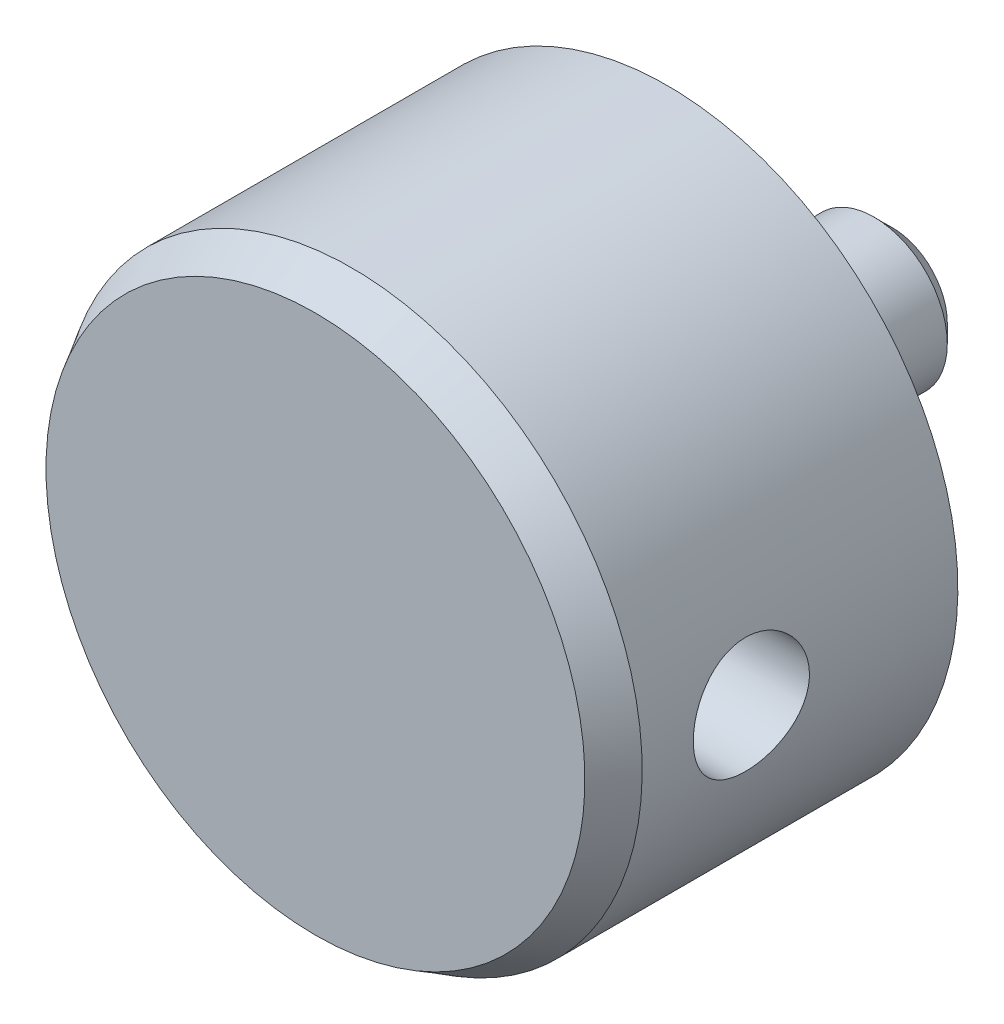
ISO-10303-21;
HEADER;
FILE_DESCRIPTION(('STEP AP214'),'2;1');
FILE_NAME('part.step','',(''),(''),'','','');
FILE_SCHEMA(('AUTOMOTIVE_DESIGN { 1 0 10303 214 1 1 1 1 }'));
ENDSEC;
DATA;
#1=APPLICATION_CONTEXT('core data for automotive mechanical design processes');
#2=APPLICATION_PROTOCOL_DEFINITION('international standard','automotive_design',2000,#1);
#3=PRODUCT_CONTEXT('',#1,'mechanical');
#4=PRODUCT('Part','Part','',(#3));
#5=PRODUCT_RELATED_PRODUCT_CATEGORY('part','',(#4));
#6=PRODUCT_DEFINITION_FORMATION('','',#4);
#7=PRODUCT_DEFINITION_CONTEXT('part definition',#1,'design');
#8=PRODUCT_DEFINITION('design','',#6,#7);
#9=PRODUCT_DEFINITION_SHAPE('','',#8);
#10=(LENGTH_UNIT() NAMED_UNIT(*) SI_UNIT(.MILLI.,.METRE.));
#11=(NAMED_UNIT(*) PLANE_ANGLE_UNIT() SI_UNIT($,.RADIAN.));
#12=(NAMED_UNIT(*) SI_UNIT($,.STERADIAN.) SOLID_ANGLE_UNIT());
#13=UNCERTAINTY_MEASURE_WITH_UNIT(LENGTH_MEASURE(1.E-05),#10,'distance_accuracy_value','');
#14=(GEOMETRIC_REPRESENTATION_CONTEXT(3) GLOBAL_UNCERTAINTY_ASSIGNED_CONTEXT((#13)) GLOBAL_UNIT_ASSIGNED_CONTEXT((#10,
#11,#12)) REPRESENTATION_CONTEXT('',''));
#15=CARTESIAN_POINT('',(0.,0.,0.));
#16=DIRECTION('',(0.,0.,1.));
#17=DIRECTION('',(1.,0.,0.));
#18=AXIS2_PLACEMENT_3D('',#15,#16,#17);
#19=CARTESIAN_POINT('',(0.,0.,-7.09946049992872));
#20=DIRECTION('',(0.,0.,-1.));
#21=DIRECTION('',(0.,-1.,0.));
#22=AXIS2_PLACEMENT_3D('',#19,#20,#21);
#23=CONICAL_SURFACE('',#22,7.99973,0.523598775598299);
#24=CARTESIAN_POINT('',(0.,0.,-4.572));
#25=DIRECTION('',(0.,0.,-1.));
#26=DIRECTION('',(0.,-1.,0.));
#27=AXIS2_PLACEMENT_3D('',#24,#25,#26);
#28=CIRCLE('',#27,6.5405);
#29=CARTESIAN_POINT('',(0.,-6.54050000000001,-4.572));
#30=VERTEX_POINT('',#29);
#31=EDGE_CURVE('E92',#30,#30,#28,.T.);
#32=ORIENTED_EDGE('',*,*,#31,.T.);
#33=EDGE_LOOP('',(#32));
#34=FACE_BOUND('',#33,.T.);
#35=CARTESIAN_POINT('',(0.,0.,-7.09992815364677));
#36=DIRECTION('',(0.,0.,1.));
#37=DIRECTION('',(1.,0.,0.));
#38=AXIS2_PLACEMENT_3D('',#35,#36,#37);
#39=CIRCLE('',#38,8.);
#40=CARTESIAN_POINT('',(8.,0.,-7.09992815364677));
#41=VERTEX_POINT('',#40);
#42=EDGE_CURVE('E95',#41,#41,#39,.T.);
#43=ORIENTED_EDGE('',*,*,#42,.T.);
#44=EDGE_LOOP('',(#43));
#45=FACE_BOUND('',#44,.T.);
#46=ADVANCED_FACE('F12',(#34,#45),#23,.T.);
#47=CARTESIAN_POINT('',(0.,0.,-23.8125));
#48=DIRECTION('',(0.,0.,-1.));
#49=DIRECTION('',(0.,-1.,0.));
#50=AXIS2_PLACEMENT_3D('',#47,#48,#49);
#51=CYLINDRICAL_SURFACE('',#50,6.5405);
#52=CARTESIAN_POINT('',(0.,0.,0.));
#53=DIRECTION('',(0.,0.,-1.));
#54=DIRECTION('',(0.,-1.,0.));
#55=AXIS2_PLACEMENT_3D('',#52,#53,#54);
#56=CIRCLE('',#55,6.5405);
#57=CARTESIAN_POINT('',(0.,-6.54050000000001,0.));
#58=VERTEX_POINT('',#57);
#59=EDGE_CURVE('E94',#58,#58,#56,.T.);
#60=ORIENTED_EDGE('',*,*,#59,.T.);
#61=EDGE_LOOP('',(#60));
#62=FACE_BOUND('',#61,.T.);
#63=ORIENTED_EDGE('',*,*,#31,.F.);
#64=EDGE_LOOP('',(#63));
#65=FACE_BOUND('',#64,.T.);
#66=ADVANCED_FACE('F61',(#62,#65),#51,.T.);
#67=CARTESIAN_POINT('',(0.,-6.5405,0.));
#68=DIRECTION('',(0.,0.,-1.));
#69=DIRECTION('',(0.,-1.,0.));
#70=AXIS2_PLACEMENT_3D('',#67,#68,#69);
#71=PLANE('',#70);
#72=CARTESIAN_POINT('',(0.,0.,0.));
#73=DIRECTION('',(0.,0.,-1.));
#74=DIRECTION('',(0.,-1.,0.));
#75=AXIS2_PLACEMENT_3D('',#72,#73,#74);
#76=CIRCLE('',#75,12.7);
#77=CARTESIAN_POINT('',(0.,-12.7,0.));
#78=VERTEX_POINT('',#77);
#79=EDGE_CURVE('E90',#78,#78,#76,.T.);
#80=ORIENTED_EDGE('',*,*,#79,.T.);
#81=EDGE_LOOP('',(#80));
#82=FACE_BOUND('',#81,.T.);
#83=ORIENTED_EDGE('',*,*,#59,.F.);
#84=EDGE_LOOP('',(#83));
#85=FACE_BOUND('',#84,.T.);
#86=ADVANCED_FACE('F68',(#82,#85),#71,.T.);
#87=CARTESIAN_POINT('',(0.,-29.4586411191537,39.27475));
#88=DIRECTION('',(0.,0.,1.));
#89=DIRECTION('',(0.,1.,0.));
#90=AXIS2_PLACEMENT_3D('',#87,#88,#89);
#91=PLANE('',#90);
#92=CARTESIAN_POINT('',(0.,0.,39.27475));
#93=DIRECTION('',(0.,0.,-1.));
#94=DIRECTION('',(0.,-1.,0.));
#95=AXIS2_PLACEMENT_3D('',#92,#93,#94);
#96=CIRCLE('',#95,29.4586411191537);
#97=CARTESIAN_POINT('',(0.,-29.4586411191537,39.27475));
#98=VERTEX_POINT('',#97);
#99=EDGE_CURVE('E87',#98,#98,#96,.T.);
#100=ORIENTED_EDGE('',*,*,#99,.F.);
#101=EDGE_LOOP('',(#100));
#102=FACE_BOUND('',#101,.T.);
#103=ADVANCED_FACE('F74',(#102),#91,.T.);
#104=CARTESIAN_POINT('',(0.,0.,-23.8125));
#105=DIRECTION('',(0.,0.,-1.));
#106=DIRECTION('',(0.,-1.,0.));
#107=AXIS2_PLACEMENT_3D('',#104,#105,#106);
#108=CYLINDRICAL_SURFACE('',#107,12.7);
#109=CARTESIAN_POINT('',(0.,0.,0.79375));
#110=DIRECTION('',(0.,0.,-1.));
#111=DIRECTION('',(0.,-1.,0.));
#112=AXIS2_PLACEMENT_3D('',#109,#110,#111);
#113=CIRCLE('',#112,12.7);
#114=CARTESIAN_POINT('',(0.,-12.7,0.79375));
#115=VERTEX_POINT('',#114);
#116=EDGE_CURVE('E38',#115,#115,#113,.T.);
#117=ORIENTED_EDGE('',*,*,#116,.T.);
#118=EDGE_LOOP('',(#117));
#119=FACE_BOUND('',#118,.T.);
#120=ORIENTED_EDGE('',*,*,#79,.F.);
#121=EDGE_LOOP('',(#120));
#122=FACE_BOUND('',#121,.T.);
#123=ADVANCED_FACE('F56',(#119,#122),#108,.T.);
#124=CARTESIAN_POINT('',(0.,0.,35.306));
#125=DIRECTION('',(0.,0.,-1.));
#126=DIRECTION('',(0.,-1.,0.));
#127=AXIS2_PLACEMENT_3D('',#124,#125,#126);
#128=CONICAL_SURFACE('',#127,31.75,0.523598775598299);
#129=ORIENTED_EDGE('',*,*,#99,.T.);
#130=EDGE_LOOP('',(#129));
#131=FACE_BOUND('',#130,.T.);
#132=CARTESIAN_POINT('',(0.,0.,35.306));
#133=DIRECTION('',(0.,0.,-1.));
#134=DIRECTION('',(0.,-1.,0.));
#135=AXIS2_PLACEMENT_3D('',#132,#133,#134);
#136=CIRCLE('',#135,31.75);
#137=CARTESIAN_POINT('',(0.,-31.75,35.306));
#138=VERTEX_POINT('',#137);
#139=EDGE_CURVE('E28',#138,#138,#136,.T.);
#140=ORIENTED_EDGE('',*,*,#139,.F.);
#141=EDGE_LOOP('',(#140));
#142=FACE_BOUND('',#141,.T.);
#143=ADVANCED_FACE('F46',(#131,#142),#128,.T.);
#144=CARTESIAN_POINT('',(0.,-12.7,0.79375));
#145=DIRECTION('',(0.,0.,-1.));
#146=DIRECTION('',(0.,-1.,0.));
#147=AXIS2_PLACEMENT_3D('',#144,#145,#146);
#148=PLANE('',#147);
#149=CARTESIAN_POINT('',(0.,0.,0.79375));
#150=DIRECTION('',(0.,0.,-1.));
#151=DIRECTION('',(0.,-1.,0.));
#152=AXIS2_PLACEMENT_3D('',#149,#150,#151);
#153=CIRCLE('',#152,31.75);
#154=CARTESIAN_POINT('',(0.,-31.75,0.79375));
#155=VERTEX_POINT('',#154);
#156=EDGE_CURVE('E32',#155,#155,#153,.T.);
#157=ORIENTED_EDGE('',*,*,#156,.T.);
#158=EDGE_LOOP('',(#157));
#159=FACE_BOUND('',#158,.T.);
#160=ORIENTED_EDGE('',*,*,#116,.F.);
#161=EDGE_LOOP('',(#160));
#162=FACE_BOUND('',#161,.T.);
#163=ADVANCED_FACE('F44',(#159,#162),#148,.T.);
#164=CARTESIAN_POINT('',(0.,0.,-23.8125));
#165=DIRECTION('',(0.,0.,-1.));
#166=DIRECTION('',(0.,-1.,0.));
#167=AXIS2_PLACEMENT_3D('',#164,#165,#166);
#168=CYLINDRICAL_SURFACE('',#167,31.75);
#169=CARTESIAN_POINT('',(-31.75,0.,17.018));
#170=CARTESIAN_POINT('',(-31.750001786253,-0.176515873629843,17.0179964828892));
#171=CARTESIAN_POINT('',(-31.7485254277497,-0.352987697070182,17.0253620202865));
#172=CARTESIAN_POINT('',(-31.7426651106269,-0.704709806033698,17.0547588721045));
#173=CARTESIAN_POINT('',(-31.7382806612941,-0.879959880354,17.076792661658));
#174=CARTESIAN_POINT('',(-31.7267212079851,-1.22801018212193,17.1353715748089));
#175=CARTESIAN_POINT('',(-31.7195447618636,-1.40080909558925,17.1719241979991));
#176=CARTESIAN_POINT('',(-31.7025988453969,-1.74270808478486,17.2592678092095));
#177=CARTESIAN_POINT('',(-31.6928284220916,-1.91180677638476,17.3100640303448));
#178=CARTESIAN_POINT('',(-31.6709811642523,-2.24483065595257,17.4254207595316));
#179=CARTESIAN_POINT('',(-31.6589074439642,-2.40876248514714,17.4899626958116));
#180=CARTESIAN_POINT('',(-31.6327719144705,-2.73062697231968,17.6323954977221));
#181=CARTESIAN_POINT('',(-31.6187093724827,-2.88855739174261,17.7102912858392));
#182=CARTESIAN_POINT('',(-31.5889902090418,-3.19722223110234,17.878812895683));
#183=CARTESIAN_POINT('',(-31.5733343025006,-3.34795983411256,17.9694330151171));
#184=CARTESIAN_POINT('',(-31.5408421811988,-3.64136966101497,18.1628283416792));
#185=CARTESIAN_POINT('',(-31.5240055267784,-3.78403884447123,18.2656080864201));
#186=CARTESIAN_POINT('',(-31.4894105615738,-4.06194074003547,18.4838705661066));
#187=CARTESIAN_POINT('',(-31.4716437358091,-4.19706617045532,18.599488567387));
#188=CARTESIAN_POINT('',(-31.435860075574,-4.45717927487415,18.8416722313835));
#189=CARTESIAN_POINT('',(-31.4178431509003,-4.58216317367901,18.9682419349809));
#190=CARTESIAN_POINT('',(-31.3820725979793,-4.82105872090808,19.2313994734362));
#191=CARTESIAN_POINT('',(-31.3643188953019,-4.93497355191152,19.3679844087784));
#192=CARTESIAN_POINT('',(-31.329560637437,-5.15103007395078,19.6503390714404));
#193=CARTESIAN_POINT('',(-31.3125563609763,-5.25316740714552,19.7961121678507));
#194=CARTESIAN_POINT('',(-31.2796421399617,-5.44574317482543,20.0971314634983));
#195=CARTESIAN_POINT('',(-31.2637430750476,-5.53607140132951,20.2524494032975));
#196=CARTESIAN_POINT('',(-31.2336627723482,-5.70333527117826,20.5703672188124));
#197=CARTESIAN_POINT('',(-31.219482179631,-5.78026589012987,20.7329697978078));
#198=CARTESIAN_POINT('',(-31.1932725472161,-5.92007801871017,21.0642092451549));
#199=CARTESIAN_POINT('',(-31.1812425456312,-5.98296581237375,21.2328433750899));
#200=CARTESIAN_POINT('',(-31.1596797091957,-6.09426120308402,21.5749779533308));
#201=CARTESIAN_POINT('',(-31.1501477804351,-6.14266354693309,21.7484801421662));
#202=CARTESIAN_POINT('',(-31.1259929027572,-6.26436580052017,22.269824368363));
#203=CARTESIAN_POINT('',(-31.1154218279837,-6.31616350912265,22.6232665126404));
#204=CARTESIAN_POINT('',(-31.1087311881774,-6.34895807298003,23.155713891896));
#205=CARTESIAN_POINT('',(-31.1080302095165,-6.35239822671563,23.3336494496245));
#206=CARTESIAN_POINT('',(-31.1096704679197,-6.34436208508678,23.6891912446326));
#207=CARTESIAN_POINT('',(-31.1120117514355,-6.33288556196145,23.8667974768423));
#208=CARTESIAN_POINT('',(-31.123422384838,-6.2766899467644,24.391719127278));
#209=CARTESIAN_POINT('',(-31.1368107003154,-6.21054564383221,24.7368888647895));
#210=CARTESIAN_POINT('',(-31.1737072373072,-6.02257965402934,25.4109501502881));
#211=CARTESIAN_POINT('',(-31.1972159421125,-5.90075530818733,25.7398409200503));
#212=CARTESIAN_POINT('',(-31.2518821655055,-5.6040326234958,26.3748075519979));
#213=CARTESIAN_POINT('',(-31.2830903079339,-5.42878112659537,26.6807141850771));
#214=CARTESIAN_POINT('',(-31.3496081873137,-5.03042913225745,27.2590987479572));
#215=CARTESIAN_POINT('',(-31.3849183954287,-4.80732313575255,27.5315728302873));
#216=CARTESIAN_POINT('',(-31.4564408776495,-4.31482460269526,28.0405156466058));
#217=CARTESIAN_POINT('',(-31.4926579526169,-4.04467162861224,28.2762485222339));
#218=CARTESIAN_POINT('',(-31.5613318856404,-3.46827489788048,28.699167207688));
#219=CARTESIAN_POINT('',(-31.5937886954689,-3.16203067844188,28.8863523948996));
#220=CARTESIAN_POINT('',(-31.6513648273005,-2.52132710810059,29.2069996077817));
#221=CARTESIAN_POINT('',(-31.6764726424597,-2.18682455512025,29.3403775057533));
#222=CARTESIAN_POINT('',(-31.7164344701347,-1.49954599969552,29.5488390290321));
#223=CARTESIAN_POINT('',(-31.7312897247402,-1.14677221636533,29.6239297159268));
#224=CARTESIAN_POINT('',(-31.7488996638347,-0.439289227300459,29.7126434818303));
#225=CARTESIAN_POINT('',(-31.751852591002,-0.0847110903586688,29.7272736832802));
#226=CARTESIAN_POINT('',(-31.7458757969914,0.621823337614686,29.6973633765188));
#227=CARTESIAN_POINT('',(-31.73694674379,0.973779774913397,29.6528261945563));
#228=CARTESIAN_POINT('',(-31.7083333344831,1.66183092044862,29.5066824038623));
#229=CARTESIAN_POINT('',(-31.6887464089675,1.99803979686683,29.405592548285));
#230=CARTESIAN_POINT('',(-31.6410055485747,2.64873510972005,29.1497764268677));
#231=CARTESIAN_POINT('',(-31.6128509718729,2.96321991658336,28.9950461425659));
#232=CARTESIAN_POINT('',(-31.5506044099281,3.56578616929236,28.6341672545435));
#233=CARTESIAN_POINT('',(-31.5164439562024,3.85349724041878,28.4274123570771));
#234=CARTESIAN_POINT('',(-31.4461355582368,4.39050548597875,27.9691476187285));
#235=CARTESIAN_POINT('',(-31.4099874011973,4.6397985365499,27.717632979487));
#236=CARTESIAN_POINT('',(-31.339111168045,5.0967637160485,27.1724694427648));
#237=CARTESIAN_POINT('',(-31.3044130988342,5.30374424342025,26.8782372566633));
#238=CARTESIAN_POINT('',(-31.240994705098,5.66539258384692,26.2583906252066));
#239=CARTESIAN_POINT('',(-31.2122741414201,5.82006248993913,25.9327774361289));
#240=CARTESIAN_POINT('',(-31.1762701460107,6.00888128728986,25.4290562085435));
#241=CARTESIAN_POINT('',(-31.1654635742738,6.06455145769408,25.2589710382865));
#242=CARTESIAN_POINT('',(-31.1464680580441,6.16137084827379,24.9145896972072));
#243=CARTESIAN_POINT('',(-31.1382781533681,6.20252539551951,24.7402950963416));
#244=CARTESIAN_POINT('',(-31.1247656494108,6.26997942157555,24.3887413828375));
#245=CARTESIAN_POINT('',(-31.1194432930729,6.2962776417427,24.2114820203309));
#246=CARTESIAN_POINT('',(-31.1118270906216,6.33380495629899,23.8553123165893));
#247=CARTESIAN_POINT('',(-31.1095331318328,6.34503461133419,23.6764020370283));
#248=CARTESIAN_POINT('',(-31.1080575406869,6.35226474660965,23.3215129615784));
#249=CARTESIAN_POINT('',(-31.1088201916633,6.34853785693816,23.1455398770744));
#250=CARTESIAN_POINT('',(-31.113309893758,6.32649775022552,22.7945503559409));
#251=CARTESIAN_POINT('',(-31.1170368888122,6.30818480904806,22.6195339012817));
#252=CARTESIAN_POINT('',(-31.1273463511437,6.25711483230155,22.2716775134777));
#253=CARTESIAN_POINT('',(-31.1339293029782,6.22435534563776,22.0988379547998));
#254=CARTESIAN_POINT('',(-31.1497552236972,6.14466408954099,21.7566485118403));
#255=CARTESIAN_POINT('',(-31.1589972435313,6.09773737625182,21.5872974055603));
#256=CARTESIAN_POINT('',(-31.179852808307,5.99018114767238,21.2535484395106));
#257=CARTESIAN_POINT('',(-31.1914613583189,5.92958046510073,21.0891409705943));
#258=CARTESIAN_POINT('',(-31.2167268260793,5.79509639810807,20.7660852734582));
#259=CARTESIAN_POINT('',(-31.2303830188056,5.72121771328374,20.6074350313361));
#260=CARTESIAN_POINT('',(-31.2593696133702,5.56066227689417,20.2968256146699));
#261=CARTESIAN_POINT('',(-31.2747007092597,5.47398021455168,20.1448692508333));
#262=CARTESIAN_POINT('',(-31.3066021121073,5.2884794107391,19.8487674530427));
#263=CARTESIAN_POINT('',(-31.3231719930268,5.18966483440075,19.7046193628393));
#264=CARTESIAN_POINT('',(-31.3573974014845,4.97872853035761,19.4225840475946));
#265=CARTESIAN_POINT('',(-31.3750667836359,4.86640554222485,19.284848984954));
#266=CARTESIAN_POINT('',(-31.4107227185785,4.63068014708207,19.0193443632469));
#267=CARTESIAN_POINT('',(-31.4287091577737,4.50728164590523,18.8915713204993));
#268=CARTESIAN_POINT('',(-31.464516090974,4.25012766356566,18.6467234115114));
#269=CARTESIAN_POINT('',(-31.4823364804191,4.11636609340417,18.5296549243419));
#270=CARTESIAN_POINT('',(-31.517300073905,3.83949929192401,18.3071427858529));
#271=CARTESIAN_POINT('',(-31.5344435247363,3.69639751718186,18.2016948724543));
#272=CARTESIAN_POINT('',(-31.5677659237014,3.40016257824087,18.0020290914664));
#273=CARTESIAN_POINT('',(-31.5839323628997,3.24693728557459,17.9079457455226));
#274=CARTESIAN_POINT('',(-31.6146312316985,2.93299471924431,17.7330805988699));
#275=CARTESIAN_POINT('',(-31.629164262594,2.77228023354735,17.6522938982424));
#276=CARTESIAN_POINT('',(-31.6561810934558,2.4445256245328,17.5046328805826));
#277=CARTESIAN_POINT('',(-31.6686661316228,2.27748939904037,17.4377501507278));
#278=CARTESIAN_POINT('',(-31.6912384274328,1.93825421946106,17.3183706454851));
#279=CARTESIAN_POINT('',(-31.7013261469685,1.76605626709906,17.265871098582));
#280=CARTESIAN_POINT('',(-31.7230870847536,1.33248673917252,17.1536066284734));
#281=CARTESIAN_POINT('',(-31.7331270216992,1.06865101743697,17.1028235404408));
#282=CARTESIAN_POINT('',(-31.7465820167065,0.536509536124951,17.0350234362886));
#283=CARTESIAN_POINT('',(-31.7499972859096,0.268203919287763,17.0180053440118));
#284=CARTESIAN_POINT('',(-31.75,0.,17.018));
#285=B_SPLINE_CURVE_WITH_KNOTS('',3,(#169,#170,#171,#172,#173,#174,#175,#176,#177,#178,#179,
#180,#181,#182,#183,#184,#185,#186,#187,#188,#189,#190,#191,#192,#193,#194,#195,#196,#197,#198,
#199,#200,#201,#202,#203,#204,#205,#206,#207,#208,#209,#210,#211,#212,#213,#214,#215,#216,#217,
#218,#219,#220,#221,#222,#223,#224,#225,#226,#227,#228,#229,#230,#231,#232,#233,#234,#235,#236,
#237,#238,#239,#240,#241,#242,#243,#244,#245,#246,#247,#248,#249,#250,#251,#252,#253,#254,#255,
#256,#257,#258,#259,#260,#261,#262,#263,#264,#265,#266,#267,#268,#269,#270,#271,#272,#273,#274,
#275,#276,#277,#278,#279,#280,#281,#282,#283,#284),.UNSPECIFIED.,.T.,.F.,(4,2,2,2,2,2,2,2,2,2,2,
2,2,2,2,2,2,2,2,2,2,2,2,2,2,2,2,2,2,2,2,2,2,2,2,2,2,2,2,2,2,2,2,2,2,2,2,2,2,2,2,2,2,2,2,2,2,4),
(0.,0.529312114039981,1.05871356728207,1.58838883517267,2.11825896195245,2.64741767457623,
3.17677186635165,3.7058895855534,4.23520538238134,4.77075073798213,5.30649454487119,
5.84208385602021,6.37787071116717,6.91834660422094,7.45902475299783,7.99946046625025,
8.54009193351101,9.60600520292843,10.1393933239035,10.672789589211,11.7225222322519,
12.772305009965,13.8291831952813,14.8861828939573,15.962196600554,17.0382241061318,
18.1159275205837,19.1935003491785,20.253049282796,21.3125386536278,22.3625013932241,
23.4125428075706,24.4754392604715,25.5384497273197,26.617647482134,27.6968020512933,
28.2341330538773,28.7712666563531,29.3084457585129,29.8456048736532,30.3730174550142,
30.9004200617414,31.4279121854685,31.9552162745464,32.4814187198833,33.0074352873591,
33.5336706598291,34.0597258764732,34.594914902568,35.1299159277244,35.665233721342,
36.2003545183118,36.7412917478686,37.2820291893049,37.8224384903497,38.3627435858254,
39.1670231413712,39.9712770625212),.UNSPECIFIED.);
#286=CARTESIAN_POINT('',(-31.75,0.,17.018));
#287=VERTEX_POINT('',#286);
#288=EDGE_CURVE('E24',#287,#287,#285,.T.);
#289=ORIENTED_EDGE('',*,*,#288,.F.);
#290=EDGE_LOOP('',(#289));
#291=FACE_BOUND('',#290,.T.);
#292=CARTESIAN_POINT('',(31.75,0.,17.018));
#293=CARTESIAN_POINT('',(31.750001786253,0.176515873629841,17.0179964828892));
#294=CARTESIAN_POINT('',(31.7485254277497,0.35298769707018,17.0253620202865));
#295=CARTESIAN_POINT('',(31.7426651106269,0.704709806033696,17.0547588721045));
#296=CARTESIAN_POINT('',(31.7382806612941,0.879959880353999,17.076792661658));
#297=CARTESIAN_POINT('',(31.7267212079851,1.22801018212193,17.1353715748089));
#298=CARTESIAN_POINT('',(31.7195447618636,1.40080909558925,17.1719241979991));
#299=CARTESIAN_POINT('',(31.7025988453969,1.74270808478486,17.2592678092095));
#300=CARTESIAN_POINT('',(31.6928284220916,1.91180677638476,17.3100640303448));
#301=CARTESIAN_POINT('',(31.6709811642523,2.24483065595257,17.4254207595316));
#302=CARTESIAN_POINT('',(31.6589074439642,2.40876248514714,17.4899626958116));
#303=CARTESIAN_POINT('',(31.6327719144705,2.73062697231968,17.6323954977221));
#304=CARTESIAN_POINT('',(31.6187093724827,2.88855739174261,17.7102912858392));
#305=CARTESIAN_POINT('',(31.5889902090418,3.19722223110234,17.878812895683));
#306=CARTESIAN_POINT('',(31.5733343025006,3.34795983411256,17.9694330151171));
#307=CARTESIAN_POINT('',(31.5408421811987,3.64136966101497,18.1628283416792));
#308=CARTESIAN_POINT('',(31.5240055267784,3.78403884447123,18.26560808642));
#309=CARTESIAN_POINT('',(31.4894105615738,4.06194074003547,18.4838705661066));
#310=CARTESIAN_POINT('',(31.4716437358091,4.19706617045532,18.599488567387));
#311=CARTESIAN_POINT('',(31.435860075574,4.45717927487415,18.8416722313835));
#312=CARTESIAN_POINT('',(31.4178431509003,4.58216317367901,18.9682419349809));
#313=CARTESIAN_POINT('',(31.3820725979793,4.82105872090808,19.2313994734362));
#314=CARTESIAN_POINT('',(31.3643188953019,4.93497355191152,19.3679844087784));
#315=CARTESIAN_POINT('',(31.329560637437,5.15103007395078,19.6503390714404));
#316=CARTESIAN_POINT('',(31.3125563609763,5.25316740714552,19.7961121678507));
#317=CARTESIAN_POINT('',(31.2796421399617,5.44574317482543,20.0971314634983));
#318=CARTESIAN_POINT('',(31.2637430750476,5.53607140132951,20.2524494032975));
#319=CARTESIAN_POINT('',(31.2336627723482,5.70333527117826,20.5703672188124));
#320=CARTESIAN_POINT('',(31.219482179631,5.78026589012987,20.7329697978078));
#321=CARTESIAN_POINT('',(31.1932725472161,5.92007801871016,21.0642092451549));
#322=CARTESIAN_POINT('',(31.1812425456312,5.98296581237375,21.2328433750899));
#323=CARTESIAN_POINT('',(31.1596797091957,6.09426120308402,21.5749779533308));
#324=CARTESIAN_POINT('',(31.1501477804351,6.14266354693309,21.7484801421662));
#325=CARTESIAN_POINT('',(31.1259929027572,6.26436580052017,22.269824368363));
#326=CARTESIAN_POINT('',(31.1154218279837,6.31616350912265,22.6232665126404));
#327=CARTESIAN_POINT('',(31.1087311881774,6.34895807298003,23.155713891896));
#328=CARTESIAN_POINT('',(31.1080302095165,6.35239822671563,23.3336494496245));
#329=CARTESIAN_POINT('',(31.1096704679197,6.34436208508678,23.6891912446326));
#330=CARTESIAN_POINT('',(31.1120117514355,6.33288556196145,23.8667974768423));
#331=CARTESIAN_POINT('',(31.123422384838,6.2766899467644,24.391719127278));
#332=CARTESIAN_POINT('',(31.1368107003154,6.2105456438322,24.7368888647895));
#333=CARTESIAN_POINT('',(31.1737072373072,6.02257965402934,25.4109501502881));
#334=CARTESIAN_POINT('',(31.1972159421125,5.90075530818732,25.7398409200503));
#335=CARTESIAN_POINT('',(31.2518821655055,5.6040326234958,26.3748075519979));
#336=CARTESIAN_POINT('',(31.2830903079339,5.42878112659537,26.6807141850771));
#337=CARTESIAN_POINT('',(31.3496081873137,5.03042913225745,27.2590987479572));
#338=CARTESIAN_POINT('',(31.3849183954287,4.80732313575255,27.5315728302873));
#339=CARTESIAN_POINT('',(31.4564408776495,4.31482460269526,28.0405156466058));
#340=CARTESIAN_POINT('',(31.4926579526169,4.04467162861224,28.2762485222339));
#341=CARTESIAN_POINT('',(31.5613318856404,3.46827489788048,28.699167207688));
#342=CARTESIAN_POINT('',(31.5937886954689,3.16203067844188,28.8863523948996));
#343=CARTESIAN_POINT('',(31.6513648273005,2.52132710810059,29.2069996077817));
#344=CARTESIAN_POINT('',(31.6764726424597,2.18682455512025,29.3403775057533));
#345=CARTESIAN_POINT('',(31.7164344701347,1.49954599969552,29.5488390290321));
#346=CARTESIAN_POINT('',(31.7312897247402,1.14677221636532,29.6239297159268));
#347=CARTESIAN_POINT('',(31.7488996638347,0.439289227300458,29.7126434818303));
#348=CARTESIAN_POINT('',(31.751852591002,0.0847110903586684,29.7272736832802));
#349=CARTESIAN_POINT('',(31.7458757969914,-0.621823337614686,29.6973633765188));
#350=CARTESIAN_POINT('',(31.73694674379,-0.973779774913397,29.6528261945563));
#351=CARTESIAN_POINT('',(31.7083333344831,-1.66183092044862,29.5066824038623));
#352=CARTESIAN_POINT('',(31.6887464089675,-1.99803979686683,29.405592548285));
#353=CARTESIAN_POINT('',(31.6410055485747,-2.64873510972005,29.1497764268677));
#354=CARTESIAN_POINT('',(31.6128509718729,-2.96321991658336,28.9950461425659));
#355=CARTESIAN_POINT('',(31.5506044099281,-3.56578616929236,28.6341672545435));
#356=CARTESIAN_POINT('',(31.5164439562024,-3.85349724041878,28.4274123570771));
#357=CARTESIAN_POINT('',(31.4461355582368,-4.39050548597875,27.9691476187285));
#358=CARTESIAN_POINT('',(31.4099874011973,-4.6397985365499,27.717632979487));
#359=CARTESIAN_POINT('',(31.339111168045,-5.09676371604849,27.1724694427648));
#360=CARTESIAN_POINT('',(31.3044130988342,-5.30374424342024,26.8782372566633));
#361=CARTESIAN_POINT('',(31.240994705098,-5.66539258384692,26.2583906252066));
#362=CARTESIAN_POINT('',(31.2122741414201,-5.82006248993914,25.932777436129));
#363=CARTESIAN_POINT('',(31.1762701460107,-6.00888128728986,25.4290562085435));
#364=CARTESIAN_POINT('',(31.1654635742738,-6.06455145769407,25.2589710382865));
#365=CARTESIAN_POINT('',(31.1464680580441,-6.16137084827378,24.9145896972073));
#366=CARTESIAN_POINT('',(31.1382781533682,-6.20252539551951,24.7402950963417));
#367=CARTESIAN_POINT('',(31.1247656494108,-6.26997942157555,24.3887413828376));
#368=CARTESIAN_POINT('',(31.1194432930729,-6.2962776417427,24.2114820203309));
#369=CARTESIAN_POINT('',(31.1118270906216,-6.33380495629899,23.8553123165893));
#370=CARTESIAN_POINT('',(31.1095331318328,-6.34503461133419,23.6764020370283));
#371=CARTESIAN_POINT('',(31.1080575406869,-6.35226474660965,23.3215129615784));
#372=CARTESIAN_POINT('',(31.1088201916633,-6.34853785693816,23.1455398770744));
#373=CARTESIAN_POINT('',(31.1133098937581,-6.32649775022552,22.7945503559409));
#374=CARTESIAN_POINT('',(31.1170368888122,-6.30818480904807,22.6195339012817));
#375=CARTESIAN_POINT('',(31.1273463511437,-6.25711483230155,22.2716775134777));
#376=CARTESIAN_POINT('',(31.1339293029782,-6.22435534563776,22.0988379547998));
#377=CARTESIAN_POINT('',(31.1497552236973,-6.14466408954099,21.7566485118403));
#378=CARTESIAN_POINT('',(31.1589972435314,-6.09773737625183,21.5872974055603));
#379=CARTESIAN_POINT('',(31.179852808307,-5.99018114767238,21.2535484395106));
#380=CARTESIAN_POINT('',(31.1914613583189,-5.92958046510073,21.0891409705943));
#381=CARTESIAN_POINT('',(31.2167268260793,-5.79509639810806,20.7660852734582));
#382=CARTESIAN_POINT('',(31.2303830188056,-5.72121771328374,20.607435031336));
#383=CARTESIAN_POINT('',(31.2593696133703,-5.56066227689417,20.2968256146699));
#384=CARTESIAN_POINT('',(31.2747007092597,-5.47398021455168,20.1448692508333));
#385=CARTESIAN_POINT('',(31.3066021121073,-5.2884794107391,19.8487674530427));
#386=CARTESIAN_POINT('',(31.3231719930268,-5.18966483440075,19.7046193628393));
#387=CARTESIAN_POINT('',(31.3573974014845,-4.97872853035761,19.4225840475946));
#388=CARTESIAN_POINT('',(31.3750667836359,-4.86640554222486,19.284848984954));
#389=CARTESIAN_POINT('',(31.4107227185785,-4.63068014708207,19.0193443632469));
#390=CARTESIAN_POINT('',(31.4287091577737,-4.50728164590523,18.8915713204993));
#391=CARTESIAN_POINT('',(31.464516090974,-4.25012766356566,18.6467234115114));
#392=CARTESIAN_POINT('',(31.4823364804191,-4.11636609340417,18.5296549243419));
#393=CARTESIAN_POINT('',(31.517300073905,-3.83949929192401,18.3071427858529));
#394=CARTESIAN_POINT('',(31.5344435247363,-3.69639751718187,18.2016948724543));
#395=CARTESIAN_POINT('',(31.5677659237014,-3.40016257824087,18.0020290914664));
#396=CARTESIAN_POINT('',(31.5839323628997,-3.24693728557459,17.9079457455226));
#397=CARTESIAN_POINT('',(31.6146312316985,-2.93299471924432,17.7330805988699));
#398=CARTESIAN_POINT('',(31.629164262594,-2.77228023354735,17.6522938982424));
#399=CARTESIAN_POINT('',(31.6561810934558,-2.4445256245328,17.5046328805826));
#400=CARTESIAN_POINT('',(31.6686661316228,-2.27748939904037,17.4377501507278));
#401=CARTESIAN_POINT('',(31.6912384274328,-1.93825421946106,17.3183706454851));
#402=CARTESIAN_POINT('',(31.7013261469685,-1.76605626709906,17.265871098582));
#403=CARTESIAN_POINT('',(31.7230870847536,-1.33248673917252,17.1536066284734));
#404=CARTESIAN_POINT('',(31.7331270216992,-1.06865101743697,17.1028235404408));
#405=CARTESIAN_POINT('',(31.7465820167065,-0.536509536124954,17.0350234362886));
#406=CARTESIAN_POINT('',(31.7499972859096,-0.268203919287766,17.0180053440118));
#407=CARTESIAN_POINT('',(31.75,0.,17.018));
#408=B_SPLINE_CURVE_WITH_KNOTS('',3,(#292,#293,#294,#295,#296,#297,#298,#299,#300,#301,#302,
#303,#304,#305,#306,#307,#308,#309,#310,#311,#312,#313,#314,#315,#316,#317,#318,#319,#320,#321,
#322,#323,#324,#325,#326,#327,#328,#329,#330,#331,#332,#333,#334,#335,#336,#337,#338,#339,#340,
#341,#342,#343,#344,#345,#346,#347,#348,#349,#350,#351,#352,#353,#354,#355,#356,#357,#358,#359,
#360,#361,#362,#363,#364,#365,#366,#367,#368,#369,#370,#371,#372,#373,#374,#375,#376,#377,#378,
#379,#380,#381,#382,#383,#384,#385,#386,#387,#388,#389,#390,#391,#392,#393,#394,#395,#396,#397,
#398,#399,#400,#401,#402,#403,#404,#405,#406,#407),.UNSPECIFIED.,.T.,.F.,(4,2,2,2,2,2,2,2,2,2,2,
2,2,2,2,2,2,2,2,2,2,2,2,2,2,2,2,2,2,2,2,2,2,2,2,2,2,2,2,2,2,2,2,2,2,2,2,2,2,2,2,2,2,2,2,2,2,4),
(0.,0.529312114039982,1.05871356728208,1.58838883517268,2.11825896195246,2.64741767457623,
3.17677186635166,3.7058895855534,4.23520538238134,4.77075073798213,5.30649454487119,
5.8420838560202,6.37787071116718,6.91834660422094,7.45902475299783,7.99946046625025,
8.54009193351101,9.60600520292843,10.1393933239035,10.672789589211,11.7225222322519,
12.772305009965,13.8291831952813,14.8861828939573,15.962196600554,17.0382241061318,
18.1159275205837,19.1935003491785,20.253049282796,21.3125386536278,22.3625013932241,
23.4125428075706,24.4754392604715,25.5384497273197,26.617647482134,27.6968020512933,
28.2341330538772,28.7712666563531,29.3084457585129,29.8456048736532,30.3730174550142,
30.9004200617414,31.4279121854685,31.9552162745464,32.4814187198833,33.0074352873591,
33.5336706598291,34.0597258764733,34.5949149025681,35.1299159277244,35.665233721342,
36.2003545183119,36.7412917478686,37.2820291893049,37.8224384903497,38.3627435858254,
39.1670231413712,39.9712770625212),.UNSPECIFIED.);
#409=CARTESIAN_POINT('',(31.75,0.,17.018));
#410=VERTEX_POINT('',#409);
#411=EDGE_CURVE('E8',#410,#410,#408,.T.);
#412=ORIENTED_EDGE('',*,*,#411,.F.);
#413=EDGE_LOOP('',(#412));
#414=FACE_BOUND('',#413,.T.);
#415=ORIENTED_EDGE('',*,*,#156,.F.);
#416=EDGE_LOOP('',(#415));
#417=FACE_BOUND('',#416,.T.);
#418=ORIENTED_EDGE('',*,*,#139,.T.);
#419=EDGE_LOOP('',(#418));
#420=FACE_BOUND('',#419,.T.);
#421=ADVANCED_FACE('F40',(#291,#414,#417,#420),#168,.T.);
#422=CARTESIAN_POINT('',(-48.41748,0.,23.368));
#423=DIRECTION('',(1.,0.,0.));
#424=DIRECTION('',(0.,0.,-1.));
#425=AXIS2_PLACEMENT_3D('',#422,#423,#424);
#426=CYLINDRICAL_SURFACE('',#425,6.35);
#427=ORIENTED_EDGE('',*,*,#288,.T.);
#428=EDGE_LOOP('',(#427));
#429=FACE_BOUND('',#428,.T.);
#430=ORIENTED_EDGE('',*,*,#411,.T.);
#431=EDGE_LOOP('',(#430));
#432=FACE_BOUND('',#431,.T.);
#433=ADVANCED_FACE('F14',(#429,#432),#426,.F.);
#434=CARTESIAN_POINT('',(0.,0.,9.17063103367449));
#435=DIRECTION('',(0.,0.,1.));
#436=DIRECTION('',(1.,0.,0.));
#437=AXIS2_PLACEMENT_3D('',#434,#435,#436);
#438=CYLINDRICAL_SURFACE('',#437,8.);
#439=ORIENTED_EDGE('',*,*,#42,.F.);
#440=EDGE_LOOP('',(#439));
#441=FACE_BOUND('',#440,.T.);
#442=CARTESIAN_POINT('',(0.,0.,-21.8));
#443=DIRECTION('',(0.,0.,1.));
#444=DIRECTION('',(1.,0.,0.));
#445=AXIS2_PLACEMENT_3D('',#442,#443,#444);
#446=CIRCLE('',#445,8.);
#447=CARTESIAN_POINT('',(8.,0.,-21.8));
#448=VERTEX_POINT('',#447);
#449=EDGE_CURVE('E102',#448,#448,#446,.T.);
#450=ORIENTED_EDGE('',*,*,#449,.T.);
#451=EDGE_LOOP('',(#450));
#452=FACE_BOUND('',#451,.T.);
#453=ADVANCED_FACE('F118',(#441,#452),#438,.T.);
#454=CARTESIAN_POINT('',(0.,0.,-23.8));
#455=DIRECTION('',(0.,0.,1.));
#456=DIRECTION('',(1.,0.,0.));
#457=AXIS2_PLACEMENT_3D('',#454,#455,#456);
#458=CONICAL_SURFACE('',#457,6.,0.785398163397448);
#459=ORIENTED_EDGE('',*,*,#449,.F.);
#460=EDGE_LOOP('',(#459));
#461=FACE_BOUND('',#460,.T.);
#462=CARTESIAN_POINT('',(0.,0.,-23.8));
#463=DIRECTION('',(0.,0.,1.));
#464=DIRECTION('',(1.,0.,0.));
#465=AXIS2_PLACEMENT_3D('',#462,#463,#464);
#466=CIRCLE('',#465,6.);
#467=CARTESIAN_POINT('',(6.,0.,-23.8));
#468=VERTEX_POINT('',#467);
#469=EDGE_CURVE('E105',#468,#468,#466,.T.);
#470=ORIENTED_EDGE('',*,*,#469,.T.);
#471=EDGE_LOOP('',(#470));
#472=FACE_BOUND('',#471,.T.);
#473=ADVANCED_FACE('F109',(#461,#472),#458,.T.);
#474=CARTESIAN_POINT('',(0.,6.,-23.8));
#475=DIRECTION('',(0.,0.,1.));
#476=DIRECTION('',(1.,0.,0.));
#477=AXIS2_PLACEMENT_3D('',#474,#475,#476);
#478=PLANE('',#477);
#479=ORIENTED_EDGE('',*,*,#469,.F.);
#480=EDGE_LOOP('',(#479));
#481=FACE_BOUND('',#480,.T.);
#482=ADVANCED_FACE('F111',(#481),#478,.F.);
#483=CLOSED_SHELL('',(#46,#66,#86,#103,#123,#143,#163,#421,#433,#453,#473,#482));
#484=MANIFOLD_SOLID_BREP('B1',#483);
#485=ADVANCED_BREP_SHAPE_REPRESENTATION('',(#18,#484),#14);
#486=SHAPE_DEFINITION_REPRESENTATION(#9,#485);
ENDSEC;
END-ISO-10303-21;
